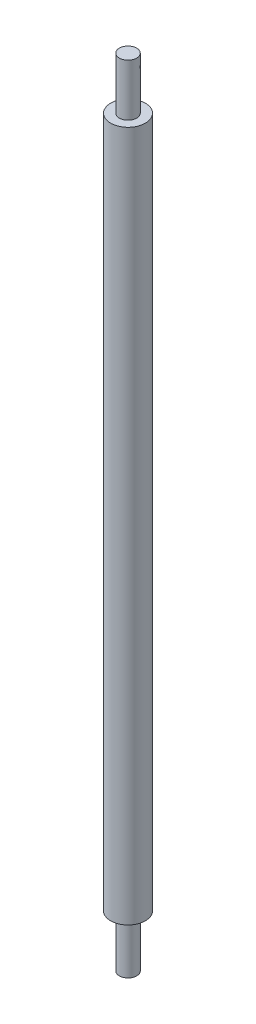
ISO-10303-21;
HEADER;
FILE_DESCRIPTION(('STEP AP214'),'2;1');
FILE_NAME('part.step','',(''),(''),'','','');
FILE_SCHEMA(('AUTOMOTIVE_DESIGN { 1 0 10303 214 1 1 1 1 }'));
ENDSEC;
DATA;
#1=APPLICATION_CONTEXT('core data for automotive mechanical design processes');
#2=APPLICATION_PROTOCOL_DEFINITION('international standard','automotive_design',2000,#1);
#3=PRODUCT_CONTEXT('',#1,'mechanical');
#4=PRODUCT('Part','Part','',(#3));
#5=PRODUCT_RELATED_PRODUCT_CATEGORY('part','',(#4));
#6=PRODUCT_DEFINITION_FORMATION('','',#4);
#7=PRODUCT_DEFINITION_CONTEXT('part definition',#1,'design');
#8=PRODUCT_DEFINITION('design','',#6,#7);
#9=PRODUCT_DEFINITION_SHAPE('','',#8);
#10=(LENGTH_UNIT() NAMED_UNIT(*) SI_UNIT(.MILLI.,.METRE.));
#11=(NAMED_UNIT(*) PLANE_ANGLE_UNIT() SI_UNIT($,.RADIAN.));
#12=(NAMED_UNIT(*) SI_UNIT($,.STERADIAN.) SOLID_ANGLE_UNIT());
#13=UNCERTAINTY_MEASURE_WITH_UNIT(LENGTH_MEASURE(1.E-05),#10,'distance_accuracy_value','');
#14=(GEOMETRIC_REPRESENTATION_CONTEXT(3) GLOBAL_UNCERTAINTY_ASSIGNED_CONTEXT((#13)) GLOBAL_UNIT_ASSIGNED_CONTEXT((#10,
#11,#12)) REPRESENTATION_CONTEXT('',''));
#15=CARTESIAN_POINT('',(0.,0.,0.));
#16=DIRECTION('',(0.,0.,1.));
#17=DIRECTION('',(1.,0.,0.));
#18=AXIS2_PLACEMENT_3D('',#15,#16,#17);
#19=CARTESIAN_POINT('',(0.,0.,0.));
#20=DIRECTION('',(0.,1.,0.));
#21=DIRECTION('',(0.,0.,1.));
#22=AXIS2_PLACEMENT_3D('',#19,#20,#21);
#23=PLANE('',#22);
#24=CARTESIAN_POINT('',(0.,0.,0.));
#25=DIRECTION('',(0.,1.,0.));
#26=DIRECTION('',(0.,0.,1.));
#27=AXIS2_PLACEMENT_3D('',#24,#25,#26);
#28=CIRCLE('',#27,3.);
#29=CARTESIAN_POINT('',(0.,0.,-3.));
#30=VERTEX_POINT('',#29);
#31=EDGE_CURVE('E42',#30,#30,#28,.T.);
#32=ORIENTED_EDGE('',*,*,#31,.F.);
#33=EDGE_LOOP('',(#32));
#34=FACE_BOUND('',#33,.T.);
#35=CARTESIAN_POINT('',(0.,0.,0.));
#36=DIRECTION('',(0.,1.,0.));
#37=DIRECTION('',(0.,0.,1.));
#38=AXIS2_PLACEMENT_3D('',#35,#36,#37);
#39=CIRCLE('',#38,1.5);
#40=CARTESIAN_POINT('',(0.,0.,1.5));
#41=VERTEX_POINT('',#40);
#42=EDGE_CURVE('E10',#41,#41,#39,.F.);
#43=ORIENTED_EDGE('',*,*,#42,.F.);
#44=EDGE_LOOP('',(#43));
#45=FACE_BOUND('',#44,.T.);
#46=ADVANCED_FACE('F31',(#34,#45),#23,.F.);
#47=CARTESIAN_POINT('',(0.,119.5,0.));
#48=DIRECTION('',(0.,1.,0.));
#49=DIRECTION('',(0.,0.,1.));
#50=AXIS2_PLACEMENT_3D('',#47,#48,#49);
#51=PLANE('',#50);
#52=CARTESIAN_POINT('',(0.,119.5,0.));
#53=DIRECTION('',(0.,1.,0.));
#54=DIRECTION('',(0.,0.,1.));
#55=AXIS2_PLACEMENT_3D('',#52,#53,#54);
#56=CIRCLE('',#55,3.);
#57=CARTESIAN_POINT('',(0.,119.5,-3.));
#58=VERTEX_POINT('',#57);
#59=EDGE_CURVE('E38',#58,#58,#56,.T.);
#60=ORIENTED_EDGE('',*,*,#59,.T.);
#61=EDGE_LOOP('',(#60));
#62=FACE_BOUND('',#61,.T.);
#63=CARTESIAN_POINT('',(0.,119.5,0.));
#64=DIRECTION('',(0.,1.,0.));
#65=DIRECTION('',(0.,0.,1.));
#66=AXIS2_PLACEMENT_3D('',#63,#64,#65);
#67=CIRCLE('',#66,1.5);
#68=CARTESIAN_POINT('',(0.,119.5,1.5));
#69=VERTEX_POINT('',#68);
#70=EDGE_CURVE('E49',#69,#69,#67,.T.);
#71=ORIENTED_EDGE('',*,*,#70,.F.);
#72=EDGE_LOOP('',(#71));
#73=FACE_BOUND('',#72,.T.);
#74=ADVANCED_FACE('F73',(#62,#73),#51,.T.);
#75=CARTESIAN_POINT('',(0.,119.5,0.));
#76=DIRECTION('',(0.,-1.,0.));
#77=DIRECTION('',(0.,0.,-1.));
#78=AXIS2_PLACEMENT_3D('',#75,#76,#77);
#79=CYLINDRICAL_SURFACE('',#78,3.);
#80=CARTESIAN_POINT('',(0.,119.5,-3.));
#81=CARTESIAN_POINT('',(0.,118.255208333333,-3.));
#82=CARTESIAN_POINT('',(0.,117.010416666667,-3.));
#83=CARTESIAN_POINT('',(0.,114.520833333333,-3.));
#84=CARTESIAN_POINT('',(0.,113.276041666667,-3.));
#85=CARTESIAN_POINT('',(0.,110.786458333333,-3.));
#86=CARTESIAN_POINT('',(0.,109.541666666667,-3.));
#87=CARTESIAN_POINT('',(0.,107.052083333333,-3.));
#88=CARTESIAN_POINT('',(0.,105.807291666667,-3.));
#89=CARTESIAN_POINT('',(0.,103.317708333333,-3.));
#90=CARTESIAN_POINT('',(0.,102.072916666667,-3.));
#91=CARTESIAN_POINT('',(0.,99.5833333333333,-3.));
#92=CARTESIAN_POINT('',(0.,98.3385416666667,-3.));
#93=CARTESIAN_POINT('',(0.,95.8489583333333,-3.));
#94=CARTESIAN_POINT('',(0.,94.6041666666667,-3.));
#95=CARTESIAN_POINT('',(0.,92.1145833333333,-3.));
#96=CARTESIAN_POINT('',(0.,90.8697916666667,-3.));
#97=CARTESIAN_POINT('',(0.,88.3802083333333,-3.));
#98=CARTESIAN_POINT('',(0.,87.1354166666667,-3.));
#99=CARTESIAN_POINT('',(0.,84.6458333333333,-3.));
#100=CARTESIAN_POINT('',(0.,83.4010416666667,-3.));
#101=CARTESIAN_POINT('',(0.,80.9114583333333,-3.));
#102=CARTESIAN_POINT('',(0.,79.6666666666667,-3.));
#103=CARTESIAN_POINT('',(0.,77.1770833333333,-3.));
#104=CARTESIAN_POINT('',(0.,75.9322916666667,-3.));
#105=CARTESIAN_POINT('',(0.,73.4427083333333,-3.));
#106=CARTESIAN_POINT('',(0.,72.1979166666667,-3.));
#107=CARTESIAN_POINT('',(0.,69.7083333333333,-3.));
#108=CARTESIAN_POINT('',(0.,68.4635416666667,-3.));
#109=CARTESIAN_POINT('',(0.,65.9739583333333,-3.));
#110=CARTESIAN_POINT('',(0.,64.7291666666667,-3.));
#111=CARTESIAN_POINT('',(0.,62.2395833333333,-3.));
#112=CARTESIAN_POINT('',(0.,60.9947916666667,-3.));
#113=CARTESIAN_POINT('',(0.,58.5052083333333,-3.));
#114=CARTESIAN_POINT('',(0.,57.2604166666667,-3.));
#115=CARTESIAN_POINT('',(0.,54.7708333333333,-3.));
#116=CARTESIAN_POINT('',(0.,53.5260416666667,-3.));
#117=CARTESIAN_POINT('',(0.,51.0364583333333,-3.));
#118=CARTESIAN_POINT('',(0.,49.7916666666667,-3.));
#119=CARTESIAN_POINT('',(0.,47.3020833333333,-3.));
#120=CARTESIAN_POINT('',(0.,46.0572916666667,-3.));
#121=CARTESIAN_POINT('',(0.,43.5677083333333,-3.));
#122=CARTESIAN_POINT('',(0.,42.3229166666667,-3.));
#123=CARTESIAN_POINT('',(0.,39.8333333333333,-3.));
#124=CARTESIAN_POINT('',(0.,38.5885416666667,-3.));
#125=CARTESIAN_POINT('',(0.,36.0989583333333,-3.));
#126=CARTESIAN_POINT('',(0.,34.8541666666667,-3.));
#127=CARTESIAN_POINT('',(0.,32.3645833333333,-3.));
#128=CARTESIAN_POINT('',(0.,31.1197916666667,-3.));
#129=CARTESIAN_POINT('',(0.,28.6302083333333,-3.));
#130=CARTESIAN_POINT('',(0.,27.3854166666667,-3.));
#131=CARTESIAN_POINT('',(0.,24.8958333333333,-3.));
#132=CARTESIAN_POINT('',(0.,23.6510416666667,-3.));
#133=CARTESIAN_POINT('',(0.,21.1614583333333,-3.));
#134=CARTESIAN_POINT('',(0.,19.9166666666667,-3.));
#135=CARTESIAN_POINT('',(0.,17.4270833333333,-3.));
#136=CARTESIAN_POINT('',(0.,16.1822916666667,-3.));
#137=CARTESIAN_POINT('',(0.,13.6927083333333,-3.));
#138=CARTESIAN_POINT('',(0.,12.4479166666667,-3.));
#139=CARTESIAN_POINT('',(0.,9.95833333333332,-3.));
#140=CARTESIAN_POINT('',(0.,8.71354166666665,-3.));
#141=CARTESIAN_POINT('',(0.,6.22395833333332,-3.));
#142=CARTESIAN_POINT('',(0.,4.97916666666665,-3.));
#143=CARTESIAN_POINT('',(0.,2.48958333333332,-3.));
#144=CARTESIAN_POINT('',(0.,1.24479166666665,-3.));
#145=CARTESIAN_POINT('',(0.,0.,-3.));
#146=B_SPLINE_CURVE_WITH_KNOTS('',3,(#80,#81,#82,#83,#84,#85,#86,#87,#88,#89,#90,#91,#92,#93,
#94,#95,#96,#97,#98,#99,#100,#101,#102,#103,#104,#105,#106,#107,#108,#109,#110,#111,#112,#113,
#114,#115,#116,#117,#118,#119,#120,#121,#122,#123,#124,#125,#126,#127,#128,#129,#130,#131,#132,
#133,#134,#135,#136,#137,#138,#139,#140,#141,#142,#143,#144,#145),.UNSPECIFIED.,.F.,.F.,(4,2,2,
2,2,2,2,2,2,2,2,2,2,2,2,2,2,2,2,2,2,2,2,2,2,2,2,2,2,2,2,2,4),(0.,3.734375,7.46875,11.203125,
14.9375,18.671875,22.40625,26.140625,29.875,33.609375,37.34375,41.078125,44.8125,48.546875,
52.28125,56.015625,59.75,63.484375,67.21875,70.953125,74.6875,78.421875,82.15625,85.890625,
89.625,93.359375,97.09375,100.828125,104.5625,108.296875,112.03125,115.765625,119.5),.UNSPECIFIED.);
#147=EDGE_CURVE('BSEAM33',#58,#30,#146,.T.);
#148=ORIENTED_EDGE('',*,*,#59,.F.);
#149=ORIENTED_EDGE('',*,*,#31,.T.);
#150=ORIENTED_EDGE('',*,*,#147,.T.);
#151=ORIENTED_EDGE('',*,*,#147,.F.);
#152=EDGE_LOOP('',(#148,#150,#149,#151));
#153=FACE_BOUND('',#152,.T.);
#154=ADVANCED_FACE('F33',(#153),#79,.T.);
#155=CARTESIAN_POINT('',(0.,128.5,0.));
#156=DIRECTION('',(0.,-1.,0.));
#157=DIRECTION('',(0.,0.,-1.));
#158=AXIS2_PLACEMENT_3D('',#155,#156,#157);
#159=CYLINDRICAL_SURFACE('',#158,1.5);
#160=CARTESIAN_POINT('',(0.,128.5,0.));
#161=DIRECTION('',(0.,1.,0.));
#162=DIRECTION('',(0.,0.,1.));
#163=AXIS2_PLACEMENT_3D('',#160,#161,#162);
#164=CIRCLE('',#163,1.5);
#165=CARTESIAN_POINT('',(0.,128.5,1.5));
#166=VERTEX_POINT('',#165);
#167=EDGE_CURVE('E47',#166,#166,#164,.T.);
#168=ORIENTED_EDGE('',*,*,#167,.F.);
#169=EDGE_LOOP('',(#168));
#170=FACE_BOUND('',#169,.T.);
#171=ORIENTED_EDGE('',*,*,#70,.T.);
#172=EDGE_LOOP('',(#171));
#173=FACE_BOUND('',#172,.T.);
#174=ADVANCED_FACE('F69',(#170,#173),#159,.T.);
#175=CARTESIAN_POINT('',(0.,128.5,0.));
#176=DIRECTION('',(0.,1.,0.));
#177=DIRECTION('',(0.,0.,1.));
#178=AXIS2_PLACEMENT_3D('',#175,#176,#177);
#179=PLANE('',#178);
#180=ORIENTED_EDGE('',*,*,#167,.T.);
#181=EDGE_LOOP('',(#180));
#182=FACE_BOUND('',#181,.T.);
#183=ADVANCED_FACE('F62',(#182),#179,.T.);
#184=CARTESIAN_POINT('',(0.,-9.,0.));
#185=DIRECTION('',(0.,1.,0.));
#186=DIRECTION('',(0.,0.,1.));
#187=AXIS2_PLACEMENT_3D('',#184,#185,#186);
#188=CYLINDRICAL_SURFACE('',#187,1.5);
#189=CARTESIAN_POINT('',(0.,-9.,0.));
#190=DIRECTION('',(0.,-1.,0.));
#191=DIRECTION('',(0.,0.,-1.));
#192=AXIS2_PLACEMENT_3D('',#189,#190,#191);
#193=CIRCLE('',#192,1.5);
#194=CARTESIAN_POINT('',(0.,-9.,-1.5));
#195=VERTEX_POINT('',#194);
#196=EDGE_CURVE('E52',#195,#195,#193,.T.);
#197=ORIENTED_EDGE('',*,*,#196,.F.);
#198=EDGE_LOOP('',(#197));
#199=FACE_BOUND('',#198,.T.);
#200=ORIENTED_EDGE('',*,*,#42,.T.);
#201=EDGE_LOOP('',(#200));
#202=FACE_BOUND('',#201,.T.);
#203=ADVANCED_FACE('F60',(#199,#202),#188,.T.);
#204=CARTESIAN_POINT('',(0.,-9.,0.));
#205=DIRECTION('',(0.,-1.,0.));
#206=DIRECTION('',(0.,0.,-1.));
#207=AXIS2_PLACEMENT_3D('',#204,#205,#206);
#208=PLANE('',#207);
#209=ORIENTED_EDGE('',*,*,#196,.T.);
#210=EDGE_LOOP('',(#209));
#211=FACE_BOUND('',#210,.T.);
#212=ADVANCED_FACE('F58',(#211),#208,.T.);
#213=CLOSED_SHELL('',(#46,#74,#154,#174,#183,#203,#212));
#214=MANIFOLD_SOLID_BREP('B2',#213);
#215=ADVANCED_BREP_SHAPE_REPRESENTATION('',(#18,#214),#14);
#216=SHAPE_DEFINITION_REPRESENTATION(#9,#215);
ENDSEC;
END-ISO-10303-21;
